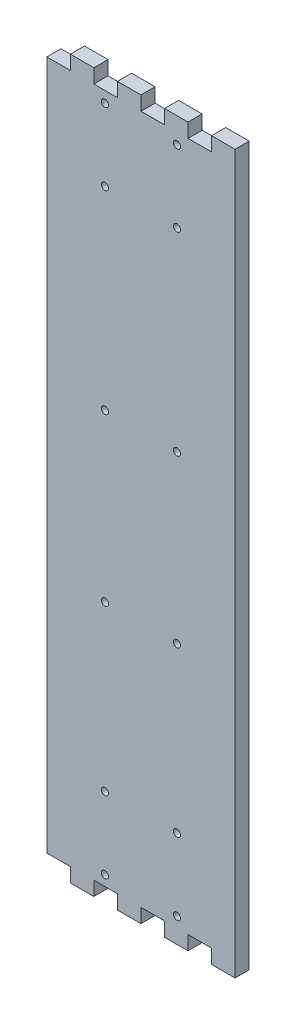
ISO-10303-21;
HEADER;
FILE_DESCRIPTION(('STEP AP214'),'2;1');
FILE_NAME('part.step','',(''),(''),'','','');
FILE_SCHEMA(('AUTOMOTIVE_DESIGN { 1 0 10303 214 1 1 1 1 }'));
ENDSEC;
DATA;
#1=APPLICATION_CONTEXT('core data for automotive mechanical design processes');
#2=APPLICATION_PROTOCOL_DEFINITION('international standard','automotive_design',2000,#1);
#3=PRODUCT_CONTEXT('',#1,'mechanical');
#4=PRODUCT('Part','Part','',(#3));
#5=PRODUCT_RELATED_PRODUCT_CATEGORY('part','',(#4));
#6=PRODUCT_DEFINITION_FORMATION('','',#4);
#7=PRODUCT_DEFINITION_CONTEXT('part definition',#1,'design');
#8=PRODUCT_DEFINITION('design','',#6,#7);
#9=PRODUCT_DEFINITION_SHAPE('','',#8);
#10=(LENGTH_UNIT() NAMED_UNIT(*) SI_UNIT(.MILLI.,.METRE.));
#11=(NAMED_UNIT(*) PLANE_ANGLE_UNIT() SI_UNIT($,.RADIAN.));
#12=(NAMED_UNIT(*) SI_UNIT($,.STERADIAN.) SOLID_ANGLE_UNIT());
#13=UNCERTAINTY_MEASURE_WITH_UNIT(LENGTH_MEASURE(1.E-05),#10,'distance_accuracy_value','');
#14=(GEOMETRIC_REPRESENTATION_CONTEXT(3) GLOBAL_UNCERTAINTY_ASSIGNED_CONTEXT((#13)) GLOBAL_UNIT_ASSIGNED_CONTEXT((#10,
#11,#12)) REPRESENTATION_CONTEXT('',''));
#15=CARTESIAN_POINT('',(0.,0.,0.));
#16=DIRECTION('',(0.,0.,1.));
#17=DIRECTION('',(1.,0.,0.));
#18=AXIS2_PLACEMENT_3D('',#15,#16,#17);
#19=CARTESIAN_POINT('',(-30.,143.,6.));
#20=DIRECTION('',(0.,-1.,0.));
#21=DIRECTION('',(0.,0.,-1.));
#22=AXIS2_PLACEMENT_3D('',#19,#20,#21);
#23=PLANE('',#22);
#24=DIRECTION('',(-1.,0.,0.));
#25=VECTOR('',#24,1.);
#26=CARTESIAN_POINT('',(-30.,143.,0.));
#27=LINE('',#26,#25);
#28=CARTESIAN_POINT('',(-30.,143.,0.));
#29=VERTEX_POINT('',#28);
#30=CARTESIAN_POINT('',(-40.0000000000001,143.,0.));
#31=VERTEX_POINT('',#30);
#32=EDGE_CURVE('E531',#29,#31,#27,.T.);
#33=ORIENTED_EDGE('',*,*,#32,.T.);
#34=DIRECTION('',(0.,0.,-1.));
#35=VECTOR('',#34,1.);
#36=CARTESIAN_POINT('',(-40.0000000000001,143.,6.));
#37=LINE('',#36,#35);
#38=CARTESIAN_POINT('',(-40.0000000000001,143.,6.));
#39=VERTEX_POINT('',#38);
#40=EDGE_CURVE('E12',#39,#31,#37,.T.);
#41=ORIENTED_EDGE('',*,*,#40,.F.);
#42=DIRECTION('',(-1.,0.,0.));
#43=VECTOR('',#42,1.);
#44=CARTESIAN_POINT('',(-30.,143.,6.));
#45=LINE('',#44,#43);
#46=CARTESIAN_POINT('',(-30.,143.,6.));
#47=VERTEX_POINT('',#46);
#48=EDGE_CURVE('E420',#47,#39,#45,.T.);
#49=ORIENTED_EDGE('',*,*,#48,.F.);
#50=DIRECTION('',(0.,0.,-1.));
#51=VECTOR('',#50,1.);
#52=CARTESIAN_POINT('',(-30.,143.,6.));
#53=LINE('',#52,#51);
#54=EDGE_CURVE('E278',#47,#29,#53,.T.);
#55=ORIENTED_EDGE('',*,*,#54,.T.);
#56=EDGE_LOOP('',(#33,#41,#49,#55));
#57=FACE_BOUND('',#56,.T.);
#58=ADVANCED_FACE('F37',(#57),#23,.F.);
#59=CARTESIAN_POINT('',(-40.0000000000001,143.,6.));
#60=DIRECTION('',(1.,0.,0.));
#61=DIRECTION('',(0.,1.,0.));
#62=AXIS2_PLACEMENT_3D('',#59,#60,#61);
#63=PLANE('',#62);
#64=DIRECTION('',(0.,-1.,0.));
#65=VECTOR('',#64,1.);
#66=CARTESIAN_POINT('',(-40.0000000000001,143.,0.));
#67=LINE('',#66,#65);
#68=CARTESIAN_POINT('',(-40.,-150.,0.));
#69=VERTEX_POINT('',#68);
#70=EDGE_CURVE('E534',#31,#69,#67,.T.);
#71=ORIENTED_EDGE('',*,*,#70,.T.);
#72=DIRECTION('',(0.,0.,-1.));
#73=VECTOR('',#72,1.);
#74=CARTESIAN_POINT('',(-40.,-150.,6.));
#75=LINE('',#74,#73);
#76=CARTESIAN_POINT('',(-40.,-150.,6.));
#77=VERTEX_POINT('',#76);
#78=EDGE_CURVE('E46',#77,#69,#75,.T.);
#79=ORIENTED_EDGE('',*,*,#78,.F.);
#80=DIRECTION('',(0.,-1.,0.));
#81=VECTOR('',#80,1.);
#82=CARTESIAN_POINT('',(-40.0000000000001,143.,6.));
#83=LINE('',#82,#81);
#84=EDGE_CURVE('E170',#39,#77,#83,.T.);
#85=ORIENTED_EDGE('',*,*,#84,.F.);
#86=ORIENTED_EDGE('',*,*,#40,.T.);
#87=EDGE_LOOP('',(#71,#79,#85,#86));
#88=FACE_BOUND('',#87,.T.);
#89=ADVANCED_FACE('F583',(#88),#63,.F.);
#90=CARTESIAN_POINT('',(-29.9999999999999,-150.,6.));
#91=DIRECTION('',(0.,1.,0.));
#92=DIRECTION('',(0.,0.,1.));
#93=AXIS2_PLACEMENT_3D('',#90,#91,#92);
#94=PLANE('',#93);
#95=DIRECTION('',(1.,0.,0.));
#96=VECTOR('',#95,1.);
#97=CARTESIAN_POINT('',(-29.9999999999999,-150.,0.));
#98=LINE('',#97,#96);
#99=CARTESIAN_POINT('',(-29.9999999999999,-150.,0.));
#100=VERTEX_POINT('',#99);
#101=EDGE_CURVE('E595',#69,#100,#98,.T.);
#102=ORIENTED_EDGE('',*,*,#101,.T.);
#103=DIRECTION('',(0.,0.,-1.));
#104=VECTOR('',#103,1.);
#105=CARTESIAN_POINT('',(-29.9999999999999,-150.,6.));
#106=LINE('',#105,#104);
#107=CARTESIAN_POINT('',(-29.9999999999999,-150.,6.));
#108=VERTEX_POINT('',#107);
#109=EDGE_CURVE('E733',#108,#100,#106,.T.);
#110=ORIENTED_EDGE('',*,*,#109,.F.);
#111=DIRECTION('',(1.,0.,0.));
#112=VECTOR('',#111,1.);
#113=CARTESIAN_POINT('',(-29.9999999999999,-150.,6.));
#114=LINE('',#113,#112);
#115=EDGE_CURVE('E409',#77,#108,#114,.T.);
#116=ORIENTED_EDGE('',*,*,#115,.F.);
#117=ORIENTED_EDGE('',*,*,#78,.T.);
#118=EDGE_LOOP('',(#102,#110,#116,#117));
#119=FACE_BOUND('',#118,.T.);
#120=ADVANCED_FACE('F588',(#119),#94,.F.);
#121=CARTESIAN_POINT('',(-29.9999999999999,-156.,6.));
#122=DIRECTION('',(1.,0.,0.));
#123=DIRECTION('',(0.,0.,-1.));
#124=AXIS2_PLACEMENT_3D('',#121,#122,#123);
#125=PLANE('',#124);
#126=DIRECTION('',(0.,-1.,0.));
#127=VECTOR('',#126,1.);
#128=CARTESIAN_POINT('',(-29.9999999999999,-156.,0.));
#129=LINE('',#128,#127);
#130=CARTESIAN_POINT('',(-29.9999999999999,-156.,0.));
#131=VERTEX_POINT('',#130);
#132=EDGE_CURVE('E598',#100,#131,#129,.T.);
#133=ORIENTED_EDGE('',*,*,#132,.T.);
#134=DIRECTION('',(0.,0.,-1.));
#135=VECTOR('',#134,1.);
#136=CARTESIAN_POINT('',(-29.9999999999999,-156.,6.));
#137=LINE('',#136,#135);
#138=CARTESIAN_POINT('',(-29.9999999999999,-156.,6.));
#139=VERTEX_POINT('',#138);
#140=EDGE_CURVE('E730',#139,#131,#137,.T.);
#141=ORIENTED_EDGE('',*,*,#140,.F.);
#142=DIRECTION('',(0.,-1.,0.));
#143=VECTOR('',#142,1.);
#144=CARTESIAN_POINT('',(-29.9999999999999,-156.,6.));
#145=LINE('',#144,#143);
#146=EDGE_CURVE('E405',#108,#139,#145,.T.);
#147=ORIENTED_EDGE('',*,*,#146,.F.);
#148=ORIENTED_EDGE('',*,*,#109,.T.);
#149=EDGE_LOOP('',(#133,#141,#147,#148));
#150=FACE_BOUND('',#149,.T.);
#151=ADVANCED_FACE('F871',(#150),#125,.F.);
#152=CARTESIAN_POINT('',(-19.9999999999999,-156.,6.));
#153=DIRECTION('',(0.,1.,0.));
#154=DIRECTION('',(0.,0.,1.));
#155=AXIS2_PLACEMENT_3D('',#152,#153,#154);
#156=PLANE('',#155);
#157=DIRECTION('',(1.,0.,0.));
#158=VECTOR('',#157,1.);
#159=CARTESIAN_POINT('',(-19.9999999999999,-156.,0.));
#160=LINE('',#159,#158);
#161=CARTESIAN_POINT('',(-19.9999999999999,-156.,0.));
#162=VERTEX_POINT('',#161);
#163=EDGE_CURVE('E602',#131,#162,#160,.T.);
#164=ORIENTED_EDGE('',*,*,#163,.T.);
#165=DIRECTION('',(0.,0.,-1.));
#166=VECTOR('',#165,1.);
#167=CARTESIAN_POINT('',(-19.9999999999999,-156.,6.));
#168=LINE('',#167,#166);
#169=CARTESIAN_POINT('',(-19.9999999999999,-156.,6.));
#170=VERTEX_POINT('',#169);
#171=EDGE_CURVE('E727',#170,#162,#168,.T.);
#172=ORIENTED_EDGE('',*,*,#171,.F.);
#173=DIRECTION('',(1.,0.,0.));
#174=VECTOR('',#173,1.);
#175=CARTESIAN_POINT('',(-19.9999999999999,-156.,6.));
#176=LINE('',#175,#174);
#177=EDGE_CURVE('E402',#139,#170,#176,.T.);
#178=ORIENTED_EDGE('',*,*,#177,.F.);
#179=ORIENTED_EDGE('',*,*,#140,.T.);
#180=EDGE_LOOP('',(#164,#172,#178,#179));
#181=FACE_BOUND('',#180,.T.);
#182=ADVANCED_FACE('F869',(#181),#156,.F.);
#183=CARTESIAN_POINT('',(-19.9999999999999,-156.,6.));
#184=DIRECTION('',(-1.,0.,0.));
#185=DIRECTION('',(0.,-1.,0.));
#186=AXIS2_PLACEMENT_3D('',#183,#184,#185);
#187=PLANE('',#186);
#188=DIRECTION('',(0.,1.,0.));
#189=VECTOR('',#188,1.);
#190=CARTESIAN_POINT('',(-19.9999999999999,-156.,0.));
#191=LINE('',#190,#189);
#192=CARTESIAN_POINT('',(-20.,-150.,0.));
#193=VERTEX_POINT('',#192);
#194=EDGE_CURVE('E604',#162,#193,#191,.T.);
#195=ORIENTED_EDGE('',*,*,#194,.T.);
#196=DIRECTION('',(0.,0.,-1.));
#197=VECTOR('',#196,1.);
#198=CARTESIAN_POINT('',(-20.,-150.,6.));
#199=LINE('',#198,#197);
#200=CARTESIAN_POINT('',(-20.,-150.,6.));
#201=VERTEX_POINT('',#200);
#202=EDGE_CURVE('E724',#201,#193,#199,.T.);
#203=ORIENTED_EDGE('',*,*,#202,.F.);
#204=DIRECTION('',(0.,1.,0.));
#205=VECTOR('',#204,1.);
#206=CARTESIAN_POINT('',(-19.9999999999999,-156.,6.));
#207=LINE('',#206,#205);
#208=EDGE_CURVE('E394',#170,#201,#207,.T.);
#209=ORIENTED_EDGE('',*,*,#208,.F.);
#210=ORIENTED_EDGE('',*,*,#171,.T.);
#211=EDGE_LOOP('',(#195,#203,#209,#210));
#212=FACE_BOUND('',#211,.T.);
#213=ADVANCED_FACE('F865',(#212),#187,.F.);
#214=CARTESIAN_POINT('',(-9.9999999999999,-150.,6.));
#215=DIRECTION('',(0.,1.,0.));
#216=DIRECTION('',(0.,0.,1.));
#217=AXIS2_PLACEMENT_3D('',#214,#215,#216);
#218=PLANE('',#217);
#219=DIRECTION('',(1.,0.,0.));
#220=VECTOR('',#219,1.);
#221=CARTESIAN_POINT('',(-9.9999999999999,-150.,0.));
#222=LINE('',#221,#220);
#223=CARTESIAN_POINT('',(-9.9999999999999,-150.,0.));
#224=VERTEX_POINT('',#223);
#225=EDGE_CURVE('E606',#193,#224,#222,.T.);
#226=ORIENTED_EDGE('',*,*,#225,.T.);
#227=DIRECTION('',(0.,0.,-1.));
#228=VECTOR('',#227,1.);
#229=CARTESIAN_POINT('',(-9.9999999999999,-150.,6.));
#230=LINE('',#229,#228);
#231=CARTESIAN_POINT('',(-9.9999999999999,-150.,6.));
#232=VERTEX_POINT('',#231);
#233=EDGE_CURVE('E721',#232,#224,#230,.T.);
#234=ORIENTED_EDGE('',*,*,#233,.F.);
#235=DIRECTION('',(1.,0.,0.));
#236=VECTOR('',#235,1.);
#237=CARTESIAN_POINT('',(-9.9999999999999,-150.,6.));
#238=LINE('',#237,#236);
#239=EDGE_CURVE('E390',#201,#232,#238,.T.);
#240=ORIENTED_EDGE('',*,*,#239,.F.);
#241=ORIENTED_EDGE('',*,*,#202,.T.);
#242=EDGE_LOOP('',(#226,#234,#240,#241));
#243=FACE_BOUND('',#242,.T.);
#244=ADVANCED_FACE('F860',(#243),#218,.F.);
#245=CARTESIAN_POINT('',(-9.9999999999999,-156.,6.));
#246=DIRECTION('',(1.,0.,0.));
#247=DIRECTION('',(0.,0.,-1.));
#248=AXIS2_PLACEMENT_3D('',#245,#246,#247);
#249=PLANE('',#248);
#250=DIRECTION('',(0.,-1.,0.));
#251=VECTOR('',#250,1.);
#252=CARTESIAN_POINT('',(-9.9999999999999,-156.,0.));
#253=LINE('',#252,#251);
#254=CARTESIAN_POINT('',(-9.9999999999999,-156.,0.));
#255=VERTEX_POINT('',#254);
#256=EDGE_CURVE('E608',#224,#255,#253,.T.);
#257=ORIENTED_EDGE('',*,*,#256,.T.);
#258=DIRECTION('',(0.,0.,-1.));
#259=VECTOR('',#258,1.);
#260=CARTESIAN_POINT('',(-9.9999999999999,-156.,6.));
#261=LINE('',#260,#259);
#262=CARTESIAN_POINT('',(-9.9999999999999,-156.,6.));
#263=VERTEX_POINT('',#262);
#264=EDGE_CURVE('E718',#263,#255,#261,.T.);
#265=ORIENTED_EDGE('',*,*,#264,.F.);
#266=DIRECTION('',(0.,-1.,0.));
#267=VECTOR('',#266,1.);
#268=CARTESIAN_POINT('',(-9.9999999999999,-156.,6.));
#269=LINE('',#268,#267);
#270=EDGE_CURVE('E386',#232,#263,#269,.T.);
#271=ORIENTED_EDGE('',*,*,#270,.F.);
#272=ORIENTED_EDGE('',*,*,#233,.T.);
#273=EDGE_LOOP('',(#257,#265,#271,#272));
#274=FACE_BOUND('',#273,.T.);
#275=ADVANCED_FACE('F854',(#274),#249,.F.);
#276=CARTESIAN_POINT('',(0.,-156.,6.));
#277=DIRECTION('',(0.,1.,0.));
#278=DIRECTION('',(0.,0.,1.));
#279=AXIS2_PLACEMENT_3D('',#276,#277,#278);
#280=PLANE('',#279);
#281=DIRECTION('',(1.,0.,0.));
#282=VECTOR('',#281,1.);
#283=CARTESIAN_POINT('',(0.,-156.,0.));
#284=LINE('',#283,#282);
#285=CARTESIAN_POINT('',(0.,-156.,0.));
#286=VERTEX_POINT('',#285);
#287=EDGE_CURVE('E610',#255,#286,#284,.T.);
#288=ORIENTED_EDGE('',*,*,#287,.T.);
#289=DIRECTION('',(0.,0.,-1.));
#290=VECTOR('',#289,1.);
#291=CARTESIAN_POINT('',(0.,-156.,6.));
#292=LINE('',#291,#290);
#293=CARTESIAN_POINT('',(0.,-156.,6.));
#294=VERTEX_POINT('',#293);
#295=EDGE_CURVE('E715',#294,#286,#292,.T.);
#296=ORIENTED_EDGE('',*,*,#295,.F.);
#297=DIRECTION('',(1.,0.,0.));
#298=VECTOR('',#297,1.);
#299=CARTESIAN_POINT('',(0.,-156.,6.));
#300=LINE('',#299,#298);
#301=EDGE_CURVE('E383',#263,#294,#300,.T.);
#302=ORIENTED_EDGE('',*,*,#301,.F.);
#303=ORIENTED_EDGE('',*,*,#264,.T.);
#304=EDGE_LOOP('',(#288,#296,#302,#303));
#305=FACE_BOUND('',#304,.T.);
#306=ADVANCED_FACE('F850',(#305),#280,.F.);
#307=CARTESIAN_POINT('',(0.,-156.,6.));
#308=DIRECTION('',(-1.,0.,0.));
#309=DIRECTION('',(0.,-1.,0.));
#310=AXIS2_PLACEMENT_3D('',#307,#308,#309);
#311=PLANE('',#310);
#312=DIRECTION('',(0.,1.,0.));
#313=VECTOR('',#312,1.);
#314=CARTESIAN_POINT('',(0.,-156.,0.));
#315=LINE('',#314,#313);
#316=CARTESIAN_POINT('',(0.,-150.,0.));
#317=VERTEX_POINT('',#316);
#318=EDGE_CURVE('E612',#286,#317,#315,.T.);
#319=ORIENTED_EDGE('',*,*,#318,.T.);
#320=DIRECTION('',(0.,0.,-1.));
#321=VECTOR('',#320,1.);
#322=CARTESIAN_POINT('',(0.,-150.,6.));
#323=LINE('',#322,#321);
#324=CARTESIAN_POINT('',(0.,-150.,6.));
#325=VERTEX_POINT('',#324);
#326=EDGE_CURVE('E712',#325,#317,#323,.T.);
#327=ORIENTED_EDGE('',*,*,#326,.F.);
#328=DIRECTION('',(0.,1.,0.));
#329=VECTOR('',#328,1.);
#330=CARTESIAN_POINT('',(0.,-156.,6.));
#331=LINE('',#330,#329);
#332=EDGE_CURVE('E375',#294,#325,#331,.T.);
#333=ORIENTED_EDGE('',*,*,#332,.F.);
#334=ORIENTED_EDGE('',*,*,#295,.T.);
#335=EDGE_LOOP('',(#319,#327,#333,#334));
#336=FACE_BOUND('',#335,.T.);
#337=ADVANCED_FACE('F845',(#336),#311,.F.);
#338=CARTESIAN_POINT('',(10.0000000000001,-150.,6.));
#339=DIRECTION('',(0.,1.,0.));
#340=DIRECTION('',(0.,0.,1.));
#341=AXIS2_PLACEMENT_3D('',#338,#339,#340);
#342=PLANE('',#341);
#343=DIRECTION('',(1.,0.,0.));
#344=VECTOR('',#343,1.);
#345=CARTESIAN_POINT('',(10.0000000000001,-150.,0.));
#346=LINE('',#345,#344);
#347=CARTESIAN_POINT('',(10.0000000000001,-150.,0.));
#348=VERTEX_POINT('',#347);
#349=EDGE_CURVE('E614',#317,#348,#346,.T.);
#350=ORIENTED_EDGE('',*,*,#349,.T.);
#351=DIRECTION('',(0.,0.,-1.));
#352=VECTOR('',#351,1.);
#353=CARTESIAN_POINT('',(10.0000000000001,-150.,6.));
#354=LINE('',#353,#352);
#355=CARTESIAN_POINT('',(10.0000000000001,-150.,6.));
#356=VERTEX_POINT('',#355);
#357=EDGE_CURVE('E709',#356,#348,#354,.T.);
#358=ORIENTED_EDGE('',*,*,#357,.F.);
#359=DIRECTION('',(1.,0.,0.));
#360=VECTOR('',#359,1.);
#361=CARTESIAN_POINT('',(10.0000000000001,-150.,6.));
#362=LINE('',#361,#360);
#363=EDGE_CURVE('E371',#325,#356,#362,.T.);
#364=ORIENTED_EDGE('',*,*,#363,.F.);
#365=ORIENTED_EDGE('',*,*,#326,.T.);
#366=EDGE_LOOP('',(#350,#358,#364,#365));
#367=FACE_BOUND('',#366,.T.);
#368=ADVANCED_FACE('F839',(#367),#342,.F.);
#369=CARTESIAN_POINT('',(10.0000000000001,-156.,6.));
#370=DIRECTION('',(1.,0.,0.));
#371=DIRECTION('',(0.,0.,-1.));
#372=AXIS2_PLACEMENT_3D('',#369,#370,#371);
#373=PLANE('',#372);
#374=DIRECTION('',(0.,-1.,0.));
#375=VECTOR('',#374,1.);
#376=CARTESIAN_POINT('',(10.0000000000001,-156.,0.));
#377=LINE('',#376,#375);
#378=CARTESIAN_POINT('',(10.0000000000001,-156.,0.));
#379=VERTEX_POINT('',#378);
#380=EDGE_CURVE('E616',#348,#379,#377,.T.);
#381=ORIENTED_EDGE('',*,*,#380,.T.);
#382=DIRECTION('',(0.,0.,-1.));
#383=VECTOR('',#382,1.);
#384=CARTESIAN_POINT('',(10.0000000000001,-156.,6.));
#385=LINE('',#384,#383);
#386=CARTESIAN_POINT('',(10.0000000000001,-156.,6.));
#387=VERTEX_POINT('',#386);
#388=EDGE_CURVE('E706',#387,#379,#385,.T.);
#389=ORIENTED_EDGE('',*,*,#388,.F.);
#390=DIRECTION('',(0.,-1.,0.));
#391=VECTOR('',#390,1.);
#392=CARTESIAN_POINT('',(10.0000000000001,-156.,6.));
#393=LINE('',#392,#391);
#394=EDGE_CURVE('E367',#356,#387,#393,.T.);
#395=ORIENTED_EDGE('',*,*,#394,.F.);
#396=ORIENTED_EDGE('',*,*,#357,.T.);
#397=EDGE_LOOP('',(#381,#389,#395,#396));
#398=FACE_BOUND('',#397,.T.);
#399=ADVANCED_FACE('F835',(#398),#373,.F.);
#400=CARTESIAN_POINT('',(20.0000000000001,-156.,6.));
#401=DIRECTION('',(0.,1.,0.));
#402=DIRECTION('',(0.,0.,1.));
#403=AXIS2_PLACEMENT_3D('',#400,#401,#402);
#404=PLANE('',#403);
#405=DIRECTION('',(1.,0.,0.));
#406=VECTOR('',#405,1.);
#407=CARTESIAN_POINT('',(20.0000000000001,-156.,0.));
#408=LINE('',#407,#406);
#409=CARTESIAN_POINT('',(20.0000000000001,-156.,0.));
#410=VERTEX_POINT('',#409);
#411=EDGE_CURVE('E618',#379,#410,#408,.T.);
#412=ORIENTED_EDGE('',*,*,#411,.T.);
#413=DIRECTION('',(0.,0.,-1.));
#414=VECTOR('',#413,1.);
#415=CARTESIAN_POINT('',(20.0000000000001,-156.,6.));
#416=LINE('',#415,#414);
#417=CARTESIAN_POINT('',(20.0000000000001,-156.,6.));
#418=VERTEX_POINT('',#417);
#419=EDGE_CURVE('E703',#418,#410,#416,.T.);
#420=ORIENTED_EDGE('',*,*,#419,.F.);
#421=DIRECTION('',(1.,0.,0.));
#422=VECTOR('',#421,1.);
#423=CARTESIAN_POINT('',(20.0000000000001,-156.,6.));
#424=LINE('',#423,#422);
#425=EDGE_CURVE('E364',#387,#418,#424,.T.);
#426=ORIENTED_EDGE('',*,*,#425,.F.);
#427=ORIENTED_EDGE('',*,*,#388,.T.);
#428=EDGE_LOOP('',(#412,#420,#426,#427));
#429=FACE_BOUND('',#428,.T.);
#430=ADVANCED_FACE('F830',(#429),#404,.F.);
#431=CARTESIAN_POINT('',(20.0000000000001,-156.,6.));
#432=DIRECTION('',(-1.,0.,0.));
#433=DIRECTION('',(0.,-1.,0.));
#434=AXIS2_PLACEMENT_3D('',#431,#432,#433);
#435=PLANE('',#434);
#436=DIRECTION('',(0.,1.,0.));
#437=VECTOR('',#436,1.);
#438=CARTESIAN_POINT('',(20.0000000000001,-156.,0.));
#439=LINE('',#438,#437);
#440=CARTESIAN_POINT('',(20.,-150.,0.));
#441=VERTEX_POINT('',#440);
#442=EDGE_CURVE('E620',#410,#441,#439,.T.);
#443=ORIENTED_EDGE('',*,*,#442,.T.);
#444=DIRECTION('',(0.,0.,-1.));
#445=VECTOR('',#444,1.);
#446=CARTESIAN_POINT('',(20.,-150.,6.));
#447=LINE('',#446,#445);
#448=CARTESIAN_POINT('',(20.,-150.,6.));
#449=VERTEX_POINT('',#448);
#450=EDGE_CURVE('E700',#449,#441,#447,.T.);
#451=ORIENTED_EDGE('',*,*,#450,.F.);
#452=DIRECTION('',(0.,1.,0.));
#453=VECTOR('',#452,1.);
#454=CARTESIAN_POINT('',(20.0000000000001,-156.,6.));
#455=LINE('',#454,#453);
#456=EDGE_CURVE('E356',#418,#449,#455,.T.);
#457=ORIENTED_EDGE('',*,*,#456,.F.);
#458=ORIENTED_EDGE('',*,*,#419,.T.);
#459=EDGE_LOOP('',(#443,#451,#457,#458));
#460=FACE_BOUND('',#459,.T.);
#461=ADVANCED_FACE('F824',(#460),#435,.F.);
#462=CARTESIAN_POINT('',(30.0000000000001,-150.,6.));
#463=DIRECTION('',(0.,1.,0.));
#464=DIRECTION('',(0.,0.,1.));
#465=AXIS2_PLACEMENT_3D('',#462,#463,#464);
#466=PLANE('',#465);
#467=DIRECTION('',(1.,0.,0.));
#468=VECTOR('',#467,1.);
#469=CARTESIAN_POINT('',(30.0000000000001,-150.,0.));
#470=LINE('',#469,#468);
#471=CARTESIAN_POINT('',(30.0000000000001,-150.,0.));
#472=VERTEX_POINT('',#471);
#473=EDGE_CURVE('E622',#441,#472,#470,.T.);
#474=ORIENTED_EDGE('',*,*,#473,.T.);
#475=DIRECTION('',(0.,0.,-1.));
#476=VECTOR('',#475,1.);
#477=CARTESIAN_POINT('',(30.0000000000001,-150.,6.));
#478=LINE('',#477,#476);
#479=CARTESIAN_POINT('',(30.0000000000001,-150.,6.));
#480=VERTEX_POINT('',#479);
#481=EDGE_CURVE('E697',#480,#472,#478,.T.);
#482=ORIENTED_EDGE('',*,*,#481,.F.);
#483=DIRECTION('',(1.,0.,0.));
#484=VECTOR('',#483,1.);
#485=CARTESIAN_POINT('',(30.0000000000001,-150.,6.));
#486=LINE('',#485,#484);
#487=EDGE_CURVE('E352',#449,#480,#486,.T.);
#488=ORIENTED_EDGE('',*,*,#487,.F.);
#489=ORIENTED_EDGE('',*,*,#450,.T.);
#490=EDGE_LOOP('',(#474,#482,#488,#489));
#491=FACE_BOUND('',#490,.T.);
#492=ADVANCED_FACE('F820',(#491),#466,.F.);
#493=CARTESIAN_POINT('',(30.0000000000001,-156.,6.));
#494=DIRECTION('',(1.,0.,0.));
#495=DIRECTION('',(0.,0.,-1.));
#496=AXIS2_PLACEMENT_3D('',#493,#494,#495);
#497=PLANE('',#496);
#498=DIRECTION('',(0.,-1.,0.));
#499=VECTOR('',#498,1.);
#500=CARTESIAN_POINT('',(30.0000000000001,-156.,0.));
#501=LINE('',#500,#499);
#502=CARTESIAN_POINT('',(30.0000000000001,-156.,0.));
#503=VERTEX_POINT('',#502);
#504=EDGE_CURVE('E624',#472,#503,#501,.T.);
#505=ORIENTED_EDGE('',*,*,#504,.T.);
#506=DIRECTION('',(0.,0.,-1.));
#507=VECTOR('',#506,1.);
#508=CARTESIAN_POINT('',(30.0000000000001,-156.,6.));
#509=LINE('',#508,#507);
#510=CARTESIAN_POINT('',(30.0000000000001,-156.,6.));
#511=VERTEX_POINT('',#510);
#512=EDGE_CURVE('E694',#511,#503,#509,.T.);
#513=ORIENTED_EDGE('',*,*,#512,.F.);
#514=DIRECTION('',(0.,-1.,0.));
#515=VECTOR('',#514,1.);
#516=CARTESIAN_POINT('',(30.0000000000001,-156.,6.));
#517=LINE('',#516,#515);
#518=EDGE_CURVE('E348',#480,#511,#517,.T.);
#519=ORIENTED_EDGE('',*,*,#518,.F.);
#520=ORIENTED_EDGE('',*,*,#481,.T.);
#521=EDGE_LOOP('',(#505,#513,#519,#520));
#522=FACE_BOUND('',#521,.T.);
#523=ADVANCED_FACE('F815',(#522),#497,.F.);
#524=CARTESIAN_POINT('',(40.0000000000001,-156.,6.));
#525=DIRECTION('',(0.,1.,0.));
#526=DIRECTION('',(0.,0.,1.));
#527=AXIS2_PLACEMENT_3D('',#524,#525,#526);
#528=PLANE('',#527);
#529=DIRECTION('',(1.,0.,0.));
#530=VECTOR('',#529,1.);
#531=CARTESIAN_POINT('',(40.0000000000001,-156.,0.));
#532=LINE('',#531,#530);
#533=CARTESIAN_POINT('',(40.0000000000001,-156.,0.));
#534=VERTEX_POINT('',#533);
#535=EDGE_CURVE('E626',#503,#534,#532,.T.);
#536=ORIENTED_EDGE('',*,*,#535,.T.);
#537=DIRECTION('',(0.,0.,-1.));
#538=VECTOR('',#537,1.);
#539=CARTESIAN_POINT('',(40.0000000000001,-156.,6.));
#540=LINE('',#539,#538);
#541=CARTESIAN_POINT('',(40.0000000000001,-156.,6.));
#542=VERTEX_POINT('',#541);
#543=EDGE_CURVE('E691',#542,#534,#540,.T.);
#544=ORIENTED_EDGE('',*,*,#543,.F.);
#545=DIRECTION('',(1.,0.,0.));
#546=VECTOR('',#545,1.);
#547=CARTESIAN_POINT('',(40.0000000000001,-156.,6.));
#548=LINE('',#547,#546);
#549=EDGE_CURVE('E345',#511,#542,#548,.T.);
#550=ORIENTED_EDGE('',*,*,#549,.F.);
#551=ORIENTED_EDGE('',*,*,#512,.T.);
#552=EDGE_LOOP('',(#536,#544,#550,#551));
#553=FACE_BOUND('',#552,.T.);
#554=ADVANCED_FACE('F809',(#553),#528,.F.);
#555=CARTESIAN_POINT('',(40.0000000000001,149.,6.));
#556=DIRECTION('',(-1.,0.,0.));
#557=DIRECTION('',(0.,0.,1.));
#558=AXIS2_PLACEMENT_3D('',#555,#556,#557);
#559=PLANE('',#558);
#560=DIRECTION('',(0.,1.,0.));
#561=VECTOR('',#560,1.);
#562=CARTESIAN_POINT('',(40.0000000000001,149.,0.));
#563=LINE('',#562,#561);
#564=CARTESIAN_POINT('',(40.0000000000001,149.,0.));
#565=VERTEX_POINT('',#564);
#566=EDGE_CURVE('E628',#534,#565,#563,.T.);
#567=ORIENTED_EDGE('',*,*,#566,.T.);
#568=DIRECTION('',(0.,0.,-1.));
#569=VECTOR('',#568,1.);
#570=CARTESIAN_POINT('',(40.0000000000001,149.,6.));
#571=LINE('',#570,#569);
#572=CARTESIAN_POINT('',(40.0000000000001,149.,6.));
#573=VERTEX_POINT('',#572);
#574=EDGE_CURVE('E688',#573,#565,#571,.T.);
#575=ORIENTED_EDGE('',*,*,#574,.F.);
#576=DIRECTION('',(0.,1.,0.));
#577=VECTOR('',#576,1.);
#578=CARTESIAN_POINT('',(40.0000000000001,149.,6.));
#579=LINE('',#578,#577);
#580=EDGE_CURVE('E337',#542,#573,#579,.T.);
#581=ORIENTED_EDGE('',*,*,#580,.F.);
#582=ORIENTED_EDGE('',*,*,#543,.T.);
#583=EDGE_LOOP('',(#567,#575,#581,#582));
#584=FACE_BOUND('',#583,.T.);
#585=ADVANCED_FACE('F805',(#584),#559,.F.);
#586=CARTESIAN_POINT('',(40.0000000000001,149.,6.));
#587=DIRECTION('',(0.,-1.,0.));
#588=DIRECTION('',(0.,0.,-1.));
#589=AXIS2_PLACEMENT_3D('',#586,#587,#588);
#590=PLANE('',#589);
#591=DIRECTION('',(-1.,0.,0.));
#592=VECTOR('',#591,1.);
#593=CARTESIAN_POINT('',(40.0000000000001,149.,0.));
#594=LINE('',#593,#592);
#595=CARTESIAN_POINT('',(30.0000000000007,149.,0.));
#596=VERTEX_POINT('',#595);
#597=EDGE_CURVE('E630',#565,#596,#594,.T.);
#598=ORIENTED_EDGE('',*,*,#597,.T.);
#599=DIRECTION('',(0.,0.,-1.));
#600=VECTOR('',#599,1.);
#601=CARTESIAN_POINT('',(30.0000000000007,149.,6.));
#602=LINE('',#601,#600);
#603=CARTESIAN_POINT('',(30.0000000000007,149.,6.));
#604=VERTEX_POINT('',#603);
#605=EDGE_CURVE('E685',#604,#596,#602,.T.);
#606=ORIENTED_EDGE('',*,*,#605,.F.);
#607=DIRECTION('',(-1.,0.,0.));
#608=VECTOR('',#607,1.);
#609=CARTESIAN_POINT('',(40.0000000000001,149.,6.));
#610=LINE('',#609,#608);
#611=EDGE_CURVE('E333',#573,#604,#610,.T.);
#612=ORIENTED_EDGE('',*,*,#611,.F.);
#613=ORIENTED_EDGE('',*,*,#574,.T.);
#614=EDGE_LOOP('',(#598,#606,#612,#613));
#615=FACE_BOUND('',#614,.T.);
#616=ADVANCED_FACE('F800',(#615),#590,.F.);
#617=CARTESIAN_POINT('',(30.0000000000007,149.,6.));
#618=DIRECTION('',(1.,0.,0.));
#619=DIRECTION('',(0.,0.,-1.));
#620=AXIS2_PLACEMENT_3D('',#617,#618,#619);
#621=PLANE('',#620);
#622=DIRECTION('',(0.,-1.,0.));
#623=VECTOR('',#622,1.);
#624=CARTESIAN_POINT('',(30.0000000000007,149.,0.));
#625=LINE('',#624,#623);
#626=CARTESIAN_POINT('',(30.0000000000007,143.,0.));
#627=VERTEX_POINT('',#626);
#628=EDGE_CURVE('E632',#596,#627,#625,.T.);
#629=ORIENTED_EDGE('',*,*,#628,.T.);
#630=DIRECTION('',(0.,0.,-1.));
#631=VECTOR('',#630,1.);
#632=CARTESIAN_POINT('',(30.0000000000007,143.,6.));
#633=LINE('',#632,#631);
#634=CARTESIAN_POINT('',(30.0000000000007,143.,6.));
#635=VERTEX_POINT('',#634);
#636=EDGE_CURVE('E682',#635,#627,#633,.T.);
#637=ORIENTED_EDGE('',*,*,#636,.F.);
#638=DIRECTION('',(0.,-1.,0.));
#639=VECTOR('',#638,1.);
#640=CARTESIAN_POINT('',(30.0000000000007,149.,6.));
#641=LINE('',#640,#639);
#642=EDGE_CURVE('E329',#604,#635,#641,.T.);
#643=ORIENTED_EDGE('',*,*,#642,.F.);
#644=ORIENTED_EDGE('',*,*,#605,.T.);
#645=EDGE_LOOP('',(#629,#637,#643,#644));
#646=FACE_BOUND('',#645,.T.);
#647=ADVANCED_FACE('F794',(#646),#621,.F.);
#648=CARTESIAN_POINT('',(30.0000000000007,143.,6.));
#649=DIRECTION('',(0.,-1.,0.));
#650=DIRECTION('',(0.,0.,-1.));
#651=AXIS2_PLACEMENT_3D('',#648,#649,#650);
#652=PLANE('',#651);
#653=DIRECTION('',(-1.,0.,0.));
#654=VECTOR('',#653,1.);
#655=CARTESIAN_POINT('',(30.0000000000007,143.,0.));
#656=LINE('',#655,#654);
#657=CARTESIAN_POINT('',(20.0000000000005,143.,0.));
#658=VERTEX_POINT('',#657);
#659=EDGE_CURVE('E634',#627,#658,#656,.T.);
#660=ORIENTED_EDGE('',*,*,#659,.T.);
#661=DIRECTION('',(0.,0.,-1.));
#662=VECTOR('',#661,1.);
#663=CARTESIAN_POINT('',(20.0000000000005,143.,6.));
#664=LINE('',#663,#662);
#665=CARTESIAN_POINT('',(20.0000000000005,143.,6.));
#666=VERTEX_POINT('',#665);
#667=EDGE_CURVE('E679',#666,#658,#664,.T.);
#668=ORIENTED_EDGE('',*,*,#667,.F.);
#669=DIRECTION('',(-1.,0.,0.));
#670=VECTOR('',#669,1.);
#671=CARTESIAN_POINT('',(30.0000000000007,143.,6.));
#672=LINE('',#671,#670);
#673=EDGE_CURVE('E326',#635,#666,#672,.T.);
#674=ORIENTED_EDGE('',*,*,#673,.F.);
#675=ORIENTED_EDGE('',*,*,#636,.T.);
#676=EDGE_LOOP('',(#660,#668,#674,#675));
#677=FACE_BOUND('',#676,.T.);
#678=ADVANCED_FACE('F790',(#677),#652,.F.);
#679=CARTESIAN_POINT('',(20.0000000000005,149.,6.));
#680=DIRECTION('',(-1.,0.,0.));
#681=DIRECTION('',(0.,0.,1.));
#682=AXIS2_PLACEMENT_3D('',#679,#680,#681);
#683=PLANE('',#682);
#684=DIRECTION('',(0.,1.,0.));
#685=VECTOR('',#684,1.);
#686=CARTESIAN_POINT('',(20.0000000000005,149.,0.));
#687=LINE('',#686,#685);
#688=CARTESIAN_POINT('',(20.0000000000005,149.,0.));
#689=VERTEX_POINT('',#688);
#690=EDGE_CURVE('E636',#658,#689,#687,.T.);
#691=ORIENTED_EDGE('',*,*,#690,.T.);
#692=DIRECTION('',(0.,0.,-1.));
#693=VECTOR('',#692,1.);
#694=CARTESIAN_POINT('',(20.0000000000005,149.,6.));
#695=LINE('',#694,#693);
#696=CARTESIAN_POINT('',(20.0000000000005,149.,6.));
#697=VERTEX_POINT('',#696);
#698=EDGE_CURVE('E676',#697,#689,#695,.T.);
#699=ORIENTED_EDGE('',*,*,#698,.F.);
#700=DIRECTION('',(0.,1.,0.));
#701=VECTOR('',#700,1.);
#702=CARTESIAN_POINT('',(20.0000000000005,149.,6.));
#703=LINE('',#702,#701);
#704=EDGE_CURVE('E318',#666,#697,#703,.T.);
#705=ORIENTED_EDGE('',*,*,#704,.F.);
#706=ORIENTED_EDGE('',*,*,#667,.T.);
#707=EDGE_LOOP('',(#691,#699,#705,#706));
#708=FACE_BOUND('',#707,.T.);
#709=ADVANCED_FACE('F785',(#708),#683,.F.);
#710=CARTESIAN_POINT('',(20.0000000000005,149.,6.));
#711=DIRECTION('',(0.,-1.,0.));
#712=DIRECTION('',(0.,0.,-1.));
#713=AXIS2_PLACEMENT_3D('',#710,#711,#712);
#714=PLANE('',#713);
#715=DIRECTION('',(-1.,0.,0.));
#716=VECTOR('',#715,1.);
#717=CARTESIAN_POINT('',(20.0000000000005,149.,0.));
#718=LINE('',#717,#716);
#719=CARTESIAN_POINT('',(10.0000000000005,149.,0.));
#720=VERTEX_POINT('',#719);
#721=EDGE_CURVE('E638',#689,#720,#718,.T.);
#722=ORIENTED_EDGE('',*,*,#721,.T.);
#723=DIRECTION('',(0.,0.,-1.));
#724=VECTOR('',#723,1.);
#725=CARTESIAN_POINT('',(10.0000000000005,149.,6.));
#726=LINE('',#725,#724);
#727=CARTESIAN_POINT('',(10.0000000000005,149.,6.));
#728=VERTEX_POINT('',#727);
#729=EDGE_CURVE('E673',#728,#720,#726,.T.);
#730=ORIENTED_EDGE('',*,*,#729,.F.);
#731=DIRECTION('',(-1.,0.,0.));
#732=VECTOR('',#731,1.);
#733=CARTESIAN_POINT('',(20.0000000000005,149.,6.));
#734=LINE('',#733,#732);
#735=EDGE_CURVE('E314',#697,#728,#734,.T.);
#736=ORIENTED_EDGE('',*,*,#735,.F.);
#737=ORIENTED_EDGE('',*,*,#698,.T.);
#738=EDGE_LOOP('',(#722,#730,#736,#737));
#739=FACE_BOUND('',#738,.T.);
#740=ADVANCED_FACE('F779',(#739),#714,.F.);
#741=CARTESIAN_POINT('',(10.0000000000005,149.,6.));
#742=DIRECTION('',(1.,0.,0.));
#743=DIRECTION('',(0.,0.,-1.));
#744=AXIS2_PLACEMENT_3D('',#741,#742,#743);
#745=PLANE('',#744);
#746=DIRECTION('',(0.,-1.,0.));
#747=VECTOR('',#746,1.);
#748=CARTESIAN_POINT('',(10.0000000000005,149.,0.));
#749=LINE('',#748,#747);
#750=CARTESIAN_POINT('',(10.0000000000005,143.,0.));
#751=VERTEX_POINT('',#750);
#752=EDGE_CURVE('E640',#720,#751,#749,.T.);
#753=ORIENTED_EDGE('',*,*,#752,.T.);
#754=DIRECTION('',(0.,0.,-1.));
#755=VECTOR('',#754,1.);
#756=CARTESIAN_POINT('',(10.0000000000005,143.,6.));
#757=LINE('',#756,#755);
#758=CARTESIAN_POINT('',(10.0000000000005,143.,6.));
#759=VERTEX_POINT('',#758);
#760=EDGE_CURVE('E670',#759,#751,#757,.T.);
#761=ORIENTED_EDGE('',*,*,#760,.F.);
#762=DIRECTION('',(0.,-1.,0.));
#763=VECTOR('',#762,1.);
#764=CARTESIAN_POINT('',(10.0000000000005,149.,6.));
#765=LINE('',#764,#763);
#766=EDGE_CURVE('E310',#728,#759,#765,.T.);
#767=ORIENTED_EDGE('',*,*,#766,.F.);
#768=ORIENTED_EDGE('',*,*,#729,.T.);
#769=EDGE_LOOP('',(#753,#761,#767,#768));
#770=FACE_BOUND('',#769,.T.);
#771=ADVANCED_FACE('F775',(#770),#745,.F.);
#772=CARTESIAN_POINT('',(10.0000000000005,143.,6.));
#773=DIRECTION('',(0.,-1.,0.));
#774=DIRECTION('',(0.,0.,-1.));
#775=AXIS2_PLACEMENT_3D('',#772,#773,#774);
#776=PLANE('',#775);
#777=DIRECTION('',(-1.,0.,0.));
#778=VECTOR('',#777,1.);
#779=CARTESIAN_POINT('',(10.0000000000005,143.,0.));
#780=LINE('',#779,#778);
#781=CARTESIAN_POINT('',(2.35922392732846E-13,143.,0.));
#782=VERTEX_POINT('',#781);
#783=EDGE_CURVE('E642',#751,#782,#780,.T.);
#784=ORIENTED_EDGE('',*,*,#783,.T.);
#785=DIRECTION('',(0.,0.,-1.));
#786=VECTOR('',#785,1.);
#787=CARTESIAN_POINT('',(2.35922392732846E-13,143.,6.));
#788=LINE('',#787,#786);
#789=CARTESIAN_POINT('',(2.35922392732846E-13,143.,6.));
#790=VERTEX_POINT('',#789);
#791=EDGE_CURVE('E667',#790,#782,#788,.T.);
#792=ORIENTED_EDGE('',*,*,#791,.F.);
#793=DIRECTION('',(-1.,0.,0.));
#794=VECTOR('',#793,1.);
#795=CARTESIAN_POINT('',(10.0000000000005,143.,6.));
#796=LINE('',#795,#794);
#797=EDGE_CURVE('E307',#759,#790,#796,.T.);
#798=ORIENTED_EDGE('',*,*,#797,.F.);
#799=ORIENTED_EDGE('',*,*,#760,.T.);
#800=EDGE_LOOP('',(#784,#792,#798,#799));
#801=FACE_BOUND('',#800,.T.);
#802=ADVANCED_FACE('F771',(#801),#776,.F.);
#803=CARTESIAN_POINT('',(2.35922392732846E-13,149.,6.));
#804=DIRECTION('',(-1.,0.,0.));
#805=DIRECTION('',(0.,0.,1.));
#806=AXIS2_PLACEMENT_3D('',#803,#804,#805);
#807=PLANE('',#806);
#808=DIRECTION('',(0.,1.,0.));
#809=VECTOR('',#808,1.);
#810=CARTESIAN_POINT('',(2.35922392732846E-13,149.,0.));
#811=LINE('',#810,#809);
#812=CARTESIAN_POINT('',(2.35922392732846E-13,149.,0.));
#813=VERTEX_POINT('',#812);
#814=EDGE_CURVE('E644',#782,#813,#811,.T.);
#815=ORIENTED_EDGE('',*,*,#814,.T.);
#816=DIRECTION('',(0.,0.,-1.));
#817=VECTOR('',#816,1.);
#818=CARTESIAN_POINT('',(2.35922392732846E-13,149.,6.));
#819=LINE('',#818,#817);
#820=CARTESIAN_POINT('',(2.35922392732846E-13,149.,6.));
#821=VERTEX_POINT('',#820);
#822=EDGE_CURVE('E664',#821,#813,#819,.T.);
#823=ORIENTED_EDGE('',*,*,#822,.F.);
#824=DIRECTION('',(0.,1.,0.));
#825=VECTOR('',#824,1.);
#826=CARTESIAN_POINT('',(2.35922392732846E-13,149.,6.));
#827=LINE('',#826,#825);
#828=EDGE_CURVE('E299',#790,#821,#827,.T.);
#829=ORIENTED_EDGE('',*,*,#828,.F.);
#830=ORIENTED_EDGE('',*,*,#791,.T.);
#831=EDGE_LOOP('',(#815,#823,#829,#830));
#832=FACE_BOUND('',#831,.T.);
#833=ADVANCED_FACE('F754',(#832),#807,.F.);
#834=CARTESIAN_POINT('',(2.35922392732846E-13,149.,6.));
#835=DIRECTION('',(0.,-1.,0.));
#836=DIRECTION('',(0.,0.,-1.));
#837=AXIS2_PLACEMENT_3D('',#834,#835,#836);
#838=PLANE('',#837);
#839=DIRECTION('',(-1.,0.,0.));
#840=VECTOR('',#839,1.);
#841=CARTESIAN_POINT('',(2.35922392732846E-13,149.,0.));
#842=LINE('',#841,#840);
#843=CARTESIAN_POINT('',(-9.99999999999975,149.,0.));
#844=VERTEX_POINT('',#843);
#845=EDGE_CURVE('E646',#813,#844,#842,.T.);
#846=ORIENTED_EDGE('',*,*,#845,.T.);
#847=DIRECTION('',(0.,0.,-1.));
#848=VECTOR('',#847,1.);
#849=CARTESIAN_POINT('',(-9.99999999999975,149.,6.));
#850=LINE('',#849,#848);
#851=CARTESIAN_POINT('',(-9.99999999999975,149.,6.));
#852=VERTEX_POINT('',#851);
#853=EDGE_CURVE('E661',#852,#844,#850,.T.);
#854=ORIENTED_EDGE('',*,*,#853,.F.);
#855=DIRECTION('',(-1.,0.,0.));
#856=VECTOR('',#855,1.);
#857=CARTESIAN_POINT('',(2.35922392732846E-13,149.,6.));
#858=LINE('',#857,#856);
#859=EDGE_CURVE('E295',#821,#852,#858,.T.);
#860=ORIENTED_EDGE('',*,*,#859,.F.);
#861=ORIENTED_EDGE('',*,*,#822,.T.);
#862=EDGE_LOOP('',(#846,#854,#860,#861));
#863=FACE_BOUND('',#862,.T.);
#864=ADVANCED_FACE('F758',(#863),#838,.F.);
#865=CARTESIAN_POINT('',(-9.99999999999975,149.,6.));
#866=DIRECTION('',(1.,0.,0.));
#867=DIRECTION('',(0.,0.,-1.));
#868=AXIS2_PLACEMENT_3D('',#865,#866,#867);
#869=PLANE('',#868);
#870=DIRECTION('',(0.,-1.,0.));
#871=VECTOR('',#870,1.);
#872=CARTESIAN_POINT('',(-9.99999999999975,149.,0.));
#873=LINE('',#872,#871);
#874=CARTESIAN_POINT('',(-9.99999999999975,143.,0.));
#875=VERTEX_POINT('',#874);
#876=EDGE_CURVE('E648',#844,#875,#873,.T.);
#877=ORIENTED_EDGE('',*,*,#876,.T.);
#878=DIRECTION('',(0.,0.,-1.));
#879=VECTOR('',#878,1.);
#880=CARTESIAN_POINT('',(-9.99999999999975,143.,6.));
#881=LINE('',#880,#879);
#882=CARTESIAN_POINT('',(-9.99999999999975,143.,6.));
#883=VERTEX_POINT('',#882);
#884=EDGE_CURVE('E658',#883,#875,#881,.T.);
#885=ORIENTED_EDGE('',*,*,#884,.F.);
#886=DIRECTION('',(0.,-1.,0.));
#887=VECTOR('',#886,1.);
#888=CARTESIAN_POINT('',(-9.99999999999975,149.,6.));
#889=LINE('',#888,#887);
#890=EDGE_CURVE('E291',#852,#883,#889,.T.);
#891=ORIENTED_EDGE('',*,*,#890,.F.);
#892=ORIENTED_EDGE('',*,*,#853,.T.);
#893=EDGE_LOOP('',(#877,#885,#891,#892));
#894=FACE_BOUND('',#893,.T.);
#895=ADVANCED_FACE('F763',(#894),#869,.F.);
#896=CARTESIAN_POINT('',(-9.99999999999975,143.,6.));
#897=DIRECTION('',(0.,-1.,0.));
#898=DIRECTION('',(0.,0.,-1.));
#899=AXIS2_PLACEMENT_3D('',#896,#897,#898);
#900=PLANE('',#899);
#901=DIRECTION('',(-1.,0.,0.));
#902=VECTOR('',#901,1.);
#903=CARTESIAN_POINT('',(-9.99999999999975,143.,0.));
#904=LINE('',#903,#902);
#905=CARTESIAN_POINT('',(-20.,143.,0.));
#906=VERTEX_POINT('',#905);
#907=EDGE_CURVE('E650',#875,#906,#904,.T.);
#908=ORIENTED_EDGE('',*,*,#907,.T.);
#909=DIRECTION('',(0.,0.,-1.));
#910=VECTOR('',#909,1.);
#911=CARTESIAN_POINT('',(-20.,143.,6.));
#912=LINE('',#911,#910);
#913=CARTESIAN_POINT('',(-20.,143.,6.));
#914=VERTEX_POINT('',#913);
#915=EDGE_CURVE('E271',#914,#906,#912,.T.);
#916=ORIENTED_EDGE('',*,*,#915,.F.);
#917=DIRECTION('',(-1.,0.,0.));
#918=VECTOR('',#917,1.);
#919=CARTESIAN_POINT('',(-9.99999999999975,143.,6.));
#920=LINE('',#919,#918);
#921=EDGE_CURVE('E261',#883,#914,#920,.T.);
#922=ORIENTED_EDGE('',*,*,#921,.F.);
#923=ORIENTED_EDGE('',*,*,#884,.T.);
#924=EDGE_LOOP('',(#908,#916,#922,#923));
#925=FACE_BOUND('',#924,.T.);
#926=ADVANCED_FACE('F766',(#925),#900,.F.);
#927=CARTESIAN_POINT('',(-20.,149.,6.));
#928=DIRECTION('',(-1.,0.,0.));
#929=DIRECTION('',(0.,0.,1.));
#930=AXIS2_PLACEMENT_3D('',#927,#928,#929);
#931=PLANE('',#930);
#932=DIRECTION('',(0.,1.,0.));
#933=VECTOR('',#932,1.);
#934=CARTESIAN_POINT('',(-20.,149.,0.));
#935=LINE('',#934,#933);
#936=CARTESIAN_POINT('',(-20.,149.,0.));
#937=VERTEX_POINT('',#936);
#938=EDGE_CURVE('E270',#906,#937,#935,.T.);
#939=ORIENTED_EDGE('',*,*,#938,.T.);
#940=DIRECTION('',(0.,0.,-1.));
#941=VECTOR('',#940,1.);
#942=CARTESIAN_POINT('',(-20.,149.,6.));
#943=LINE('',#942,#941);
#944=CARTESIAN_POINT('',(-20.,149.,6.));
#945=VERTEX_POINT('',#944);
#946=EDGE_CURVE('E267',#945,#937,#943,.T.);
#947=ORIENTED_EDGE('',*,*,#946,.F.);
#948=DIRECTION('',(0.,1.,0.));
#949=VECTOR('',#948,1.);
#950=CARTESIAN_POINT('',(-20.,149.,6.));
#951=LINE('',#950,#949);
#952=EDGE_CURVE('E255',#914,#945,#951,.T.);
#953=ORIENTED_EDGE('',*,*,#952,.F.);
#954=ORIENTED_EDGE('',*,*,#915,.T.);
#955=EDGE_LOOP('',(#939,#947,#953,#954));
#956=FACE_BOUND('',#955,.T.);
#957=ADVANCED_FACE('F268',(#956),#931,.F.);
#958=CARTESIAN_POINT('',(-20.,149.,6.));
#959=DIRECTION('',(0.,-1.,0.));
#960=DIRECTION('',(0.,0.,-1.));
#961=AXIS2_PLACEMENT_3D('',#958,#959,#960);
#962=PLANE('',#961);
#963=DIRECTION('',(-1.,0.,0.));
#964=VECTOR('',#963,1.);
#965=CARTESIAN_POINT('',(-20.,149.,0.));
#966=LINE('',#965,#964);
#967=CARTESIAN_POINT('',(-30.,149.,0.));
#968=VERTEX_POINT('',#967);
#969=EDGE_CURVE('E156',#937,#968,#966,.T.);
#970=ORIENTED_EDGE('',*,*,#969,.T.);
#971=DIRECTION('',(0.,0.,-1.));
#972=VECTOR('',#971,1.);
#973=CARTESIAN_POINT('',(-30.,149.,6.));
#974=LINE('',#973,#972);
#975=CARTESIAN_POINT('',(-30.,149.,6.));
#976=VERTEX_POINT('',#975);
#977=EDGE_CURVE('E272',#976,#968,#974,.T.);
#978=ORIENTED_EDGE('',*,*,#977,.F.);
#979=DIRECTION('',(-1.,0.,0.));
#980=VECTOR('',#979,1.);
#981=CARTESIAN_POINT('',(-20.,149.,6.));
#982=LINE('',#981,#980);
#983=EDGE_CURVE('E259',#945,#976,#982,.T.);
#984=ORIENTED_EDGE('',*,*,#983,.F.);
#985=ORIENTED_EDGE('',*,*,#946,.T.);
#986=EDGE_LOOP('',(#970,#978,#984,#985));
#987=FACE_BOUND('',#986,.T.);
#988=ADVANCED_FACE('F274',(#987),#962,.F.);
#989=CARTESIAN_POINT('',(-30.,149.,6.));
#990=DIRECTION('',(1.,0.,0.));
#991=DIRECTION('',(0.,0.,-1.));
#992=AXIS2_PLACEMENT_3D('',#989,#990,#991);
#993=PLANE('',#992);
#994=DIRECTION('',(0.,-1.,0.));
#995=VECTOR('',#994,1.);
#996=CARTESIAN_POINT('',(-30.,149.,0.));
#997=LINE('',#996,#995);
#998=EDGE_CURVE('E162',#968,#29,#997,.T.);
#999=ORIENTED_EDGE('',*,*,#998,.T.);
#1000=ORIENTED_EDGE('',*,*,#54,.F.);
#1001=DIRECTION('',(0.,-1.,0.));
#1002=VECTOR('',#1001,1.);
#1003=CARTESIAN_POINT('',(-30.,149.,6.));
#1004=LINE('',#1003,#1002);
#1005=EDGE_CURVE('E55',#976,#47,#1004,.T.);
#1006=ORIENTED_EDGE('',*,*,#1005,.F.);
#1007=ORIENTED_EDGE('',*,*,#977,.T.);
#1008=EDGE_LOOP('',(#999,#1000,#1006,#1007));
#1009=FACE_BOUND('',#1008,.T.);
#1010=ADVANCED_FACE('F508',(#1009),#993,.F.);
#1011=CARTESIAN_POINT('',(0.,0.,6.));
#1012=DIRECTION('',(0.,0.,1.));
#1013=DIRECTION('',(1.,0.,0.));
#1014=AXIS2_PLACEMENT_3D('',#1011,#1012,#1013);
#1015=PLANE('',#1014);
#1016=CARTESIAN_POINT('',(-15.3000000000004,-45.2999999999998,6.));
#1017=DIRECTION('',(0.,0.,1.));
#1018=DIRECTION('',(1.,0.,0.));
#1019=AXIS2_PLACEMENT_3D('',#1016,#1017,#1018);
#1020=CIRCLE('',#1019,1.5);
#1021=CARTESIAN_POINT('',(-13.8000000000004,-45.2999999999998,6.));
#1022=VERTEX_POINT('',#1021);
#1023=EDGE_CURVE('E470',#1022,#1022,#1020,.T.);
#1024=ORIENTED_EDGE('',*,*,#1023,.F.);
#1025=EDGE_LOOP('',(#1024));
#1026=FACE_BOUND('',#1025,.T.);
#1027=CARTESIAN_POINT('',(15.3000000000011,138.300000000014,6.));
#1028=DIRECTION('',(0.,0.,1.));
#1029=DIRECTION('',(1.,0.,0.));
#1030=AXIS2_PLACEMENT_3D('',#1027,#1028,#1029);
#1031=CIRCLE('',#1030,1.5);
#1032=CARTESIAN_POINT('',(16.8000000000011,138.300000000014,6.));
#1033=VERTEX_POINT('',#1032);
#1034=EDGE_CURVE('E464',#1033,#1033,#1031,.T.);
#1035=ORIENTED_EDGE('',*,*,#1034,.F.);
#1036=EDGE_LOOP('',(#1035));
#1037=FACE_BOUND('',#1036,.T.);
#1038=CARTESIAN_POINT('',(15.3000000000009,107.700000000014,6.));
#1039=DIRECTION('',(0.,0.,1.));
#1040=DIRECTION('',(1.,0.,0.));
#1041=AXIS2_PLACEMENT_3D('',#1038,#1039,#1040);
#1042=CIRCLE('',#1041,1.5);
#1043=CARTESIAN_POINT('',(16.8000000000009,107.700000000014,6.));
#1044=VERTEX_POINT('',#1043);
#1045=EDGE_CURVE('E450',#1044,#1044,#1042,.T.);
#1046=ORIENTED_EDGE('',*,*,#1045,.F.);
#1047=EDGE_LOOP('',(#1046));
#1048=FACE_BOUND('',#1047,.T.);
#1049=CARTESIAN_POINT('',(15.2999999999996,-45.3,6.));
#1050=DIRECTION('',(0.,0.,1.));
#1051=DIRECTION('',(1.,0.,0.));
#1052=AXIS2_PLACEMENT_3D('',#1049,#1050,#1051);
#1053=CIRCLE('',#1052,1.5);
#1054=CARTESIAN_POINT('',(16.7999999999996,-45.3,6.));
#1055=VERTEX_POINT('',#1054);
#1056=EDGE_CURVE('E476',#1055,#1055,#1053,.T.);
#1057=ORIENTED_EDGE('',*,*,#1056,.F.);
#1058=EDGE_LOOP('',(#1057));
#1059=FACE_BOUND('',#1058,.T.);
#1060=CARTESIAN_POINT('',(15.3000000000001,25.3,6.));
#1061=DIRECTION('',(0.,0.,1.));
#1062=DIRECTION('',(1.,0.,0.));
#1063=AXIS2_PLACEMENT_3D('',#1060,#1061,#1062);
#1064=CIRCLE('',#1063,1.5);
#1065=CARTESIAN_POINT('',(16.8000000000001,25.3,6.));
#1066=VERTEX_POINT('',#1065);
#1067=EDGE_CURVE('E491',#1066,#1066,#1064,.T.);
#1068=ORIENTED_EDGE('',*,*,#1067,.F.);
#1069=EDGE_LOOP('',(#1068));
#1070=FACE_BOUND('',#1069,.T.);
#1071=CARTESIAN_POINT('',(-15.2999999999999,25.3000000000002,6.));
#1072=DIRECTION('',(0.,0.,1.));
#1073=DIRECTION('',(1.,0.,0.));
#1074=AXIS2_PLACEMENT_3D('',#1071,#1072,#1073);
#1075=CIRCLE('',#1074,1.5);
#1076=CARTESIAN_POINT('',(-13.7999999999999,25.3000000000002,6.));
#1077=VERTEX_POINT('',#1076);
#1078=EDGE_CURVE('E479',#1077,#1077,#1075,.T.);
#1079=ORIENTED_EDGE('',*,*,#1078,.F.);
#1080=EDGE_LOOP('',(#1079));
#1081=FACE_BOUND('',#1080,.T.);
#1082=CARTESIAN_POINT('',(-15.3000000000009,-115.033288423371,6.));
#1083=DIRECTION('',(0.,0.,1.));
#1084=DIRECTION('',(1.,0.,0.));
#1085=AXIS2_PLACEMENT_3D('',#1082,#1083,#1084);
#1086=CIRCLE('',#1085,1.50000000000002);
#1087=CARTESIAN_POINT('',(-13.8000000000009,-115.033288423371,6.));
#1088=VERTEX_POINT('',#1087);
#1089=EDGE_CURVE('E434',#1088,#1088,#1086,.T.);
#1090=ORIENTED_EDGE('',*,*,#1089,.F.);
#1091=EDGE_LOOP('',(#1090));
#1092=FACE_BOUND('',#1091,.T.);
#1093=CARTESIAN_POINT('',(15.2999999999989,-145.633288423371,6.));
#1094=DIRECTION('',(0.,0.,1.));
#1095=DIRECTION('',(1.,0.,0.));
#1096=AXIS2_PLACEMENT_3D('',#1093,#1094,#1095);
#1097=CIRCLE('',#1096,1.50000000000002);
#1098=CARTESIAN_POINT('',(16.7999999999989,-145.633288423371,6.));
#1099=VERTEX_POINT('',#1098);
#1100=EDGE_CURVE('E429',#1099,#1099,#1097,.T.);
#1101=ORIENTED_EDGE('',*,*,#1100,.F.);
#1102=EDGE_LOOP('',(#1101));
#1103=FACE_BOUND('',#1102,.T.);
#1104=CARTESIAN_POINT('',(15.2999999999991,-115.033288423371,6.));
#1105=DIRECTION('',(0.,0.,1.));
#1106=DIRECTION('',(1.,0.,0.));
#1107=AXIS2_PLACEMENT_3D('',#1104,#1105,#1106);
#1108=CIRCLE('',#1107,1.50000000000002);
#1109=CARTESIAN_POINT('',(16.7999999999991,-115.033288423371,6.));
#1110=VERTEX_POINT('',#1109);
#1111=EDGE_CURVE('E435',#1110,#1110,#1108,.T.);
#1112=ORIENTED_EDGE('',*,*,#1111,.F.);
#1113=EDGE_LOOP('',(#1112));
#1114=FACE_BOUND('',#1113,.T.);
#1115=CARTESIAN_POINT('',(-15.2999999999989,138.300000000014,6.));
#1116=DIRECTION('',(0.,0.,1.));
#1117=DIRECTION('',(1.,0.,0.));
#1118=AXIS2_PLACEMENT_3D('',#1115,#1116,#1117);
#1119=CIRCLE('',#1118,1.5);
#1120=CARTESIAN_POINT('',(-13.7999999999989,138.300000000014,6.));
#1121=VERTEX_POINT('',#1120);
#1122=EDGE_CURVE('E449',#1121,#1121,#1119,.T.);
#1123=ORIENTED_EDGE('',*,*,#1122,.F.);
#1124=EDGE_LOOP('',(#1123));
#1125=FACE_BOUND('',#1124,.T.);
#1126=CARTESIAN_POINT('',(-15.2999999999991,107.700000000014,6.));
#1127=DIRECTION('',(0.,0.,1.));
#1128=DIRECTION('',(1.,0.,0.));
#1129=AXIS2_PLACEMENT_3D('',#1126,#1127,#1128);
#1130=CIRCLE('',#1129,1.50000000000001);
#1131=CARTESIAN_POINT('',(-13.7999999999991,107.700000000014,6.));
#1132=VERTEX_POINT('',#1131);
#1133=EDGE_CURVE('E456',#1132,#1132,#1130,.T.);
#1134=ORIENTED_EDGE('',*,*,#1133,.F.);
#1135=EDGE_LOOP('',(#1134));
#1136=FACE_BOUND('',#1135,.T.);
#1137=CARTESIAN_POINT('',(-15.3000000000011,-145.633288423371,6.));
#1138=DIRECTION('',(0.,0.,1.));
#1139=DIRECTION('',(1.,0.,0.));
#1140=AXIS2_PLACEMENT_3D('',#1137,#1138,#1139);
#1141=CIRCLE('',#1140,1.50000000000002);
#1142=CARTESIAN_POINT('',(-13.8000000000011,-145.633288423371,6.));
#1143=VERTEX_POINT('',#1142);
#1144=EDGE_CURVE('E423',#1143,#1143,#1141,.T.);
#1145=ORIENTED_EDGE('',*,*,#1144,.F.);
#1146=EDGE_LOOP('',(#1145));
#1147=FACE_BOUND('',#1146,.T.);
#1148=ORIENTED_EDGE('',*,*,#48,.T.);
#1149=ORIENTED_EDGE('',*,*,#84,.T.);
#1150=ORIENTED_EDGE('',*,*,#115,.T.);
#1151=ORIENTED_EDGE('',*,*,#146,.T.);
#1152=ORIENTED_EDGE('',*,*,#177,.T.);
#1153=ORIENTED_EDGE('',*,*,#208,.T.);
#1154=ORIENTED_EDGE('',*,*,#239,.T.);
#1155=ORIENTED_EDGE('',*,*,#270,.T.);
#1156=ORIENTED_EDGE('',*,*,#301,.T.);
#1157=ORIENTED_EDGE('',*,*,#332,.T.);
#1158=ORIENTED_EDGE('',*,*,#363,.T.);
#1159=ORIENTED_EDGE('',*,*,#394,.T.);
#1160=ORIENTED_EDGE('',*,*,#425,.T.);
#1161=ORIENTED_EDGE('',*,*,#456,.T.);
#1162=ORIENTED_EDGE('',*,*,#487,.T.);
#1163=ORIENTED_EDGE('',*,*,#518,.T.);
#1164=ORIENTED_EDGE('',*,*,#549,.T.);
#1165=ORIENTED_EDGE('',*,*,#580,.T.);
#1166=ORIENTED_EDGE('',*,*,#611,.T.);
#1167=ORIENTED_EDGE('',*,*,#642,.T.);
#1168=ORIENTED_EDGE('',*,*,#673,.T.);
#1169=ORIENTED_EDGE('',*,*,#704,.T.);
#1170=ORIENTED_EDGE('',*,*,#735,.T.);
#1171=ORIENTED_EDGE('',*,*,#766,.T.);
#1172=ORIENTED_EDGE('',*,*,#797,.T.);
#1173=ORIENTED_EDGE('',*,*,#828,.T.);
#1174=ORIENTED_EDGE('',*,*,#859,.T.);
#1175=ORIENTED_EDGE('',*,*,#890,.T.);
#1176=ORIENTED_EDGE('',*,*,#921,.T.);
#1177=ORIENTED_EDGE('',*,*,#952,.T.);
#1178=ORIENTED_EDGE('',*,*,#983,.T.);
#1179=ORIENTED_EDGE('',*,*,#1005,.T.);
#1180=EDGE_LOOP('',(#1148,#1149,#1150,#1151,#1152,#1153,#1154,#1155,#1156,#1157,#1158,#1159,
#1160,#1161,#1162,#1163,#1164,#1165,#1166,#1167,#1168,#1169,#1170,#1171,#1172,#1173,#1174,#1175,
#1176,#1177,#1178,#1179));
#1181=FACE_BOUND('',#1180,.T.);
#1182=ADVANCED_FACE('F257',(#1026,#1037,#1048,#1059,#1070,#1081,#1092,#1103,#1114,#1125,#1136,
#1147,#1181),#1015,.T.);
#1183=CARTESIAN_POINT('',(0.,0.,0.));
#1184=DIRECTION('',(0.,0.,1.));
#1185=DIRECTION('',(1.,0.,0.));
#1186=AXIS2_PLACEMENT_3D('',#1183,#1184,#1185);
#1187=PLANE('',#1186);
#1188=CARTESIAN_POINT('',(-15.3000000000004,-45.2999999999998,0.));
#1189=DIRECTION('',(0.,0.,1.));
#1190=DIRECTION('',(1.,0.,0.));
#1191=AXIS2_PLACEMENT_3D('',#1188,#1189,#1190);
#1192=CIRCLE('',#1191,1.5);
#1193=CARTESIAN_POINT('',(-13.8000000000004,-45.2999999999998,0.));
#1194=VERTEX_POINT('',#1193);
#1195=EDGE_CURVE('E40',#1194,#1194,#1192,.T.);
#1196=ORIENTED_EDGE('',*,*,#1195,.T.);
#1197=EDGE_LOOP('',(#1196));
#1198=FACE_BOUND('',#1197,.T.);
#1199=CARTESIAN_POINT('',(15.3000000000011,138.300000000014,0.));
#1200=DIRECTION('',(0.,0.,1.));
#1201=DIRECTION('',(1.,0.,0.));
#1202=AXIS2_PLACEMENT_3D('',#1199,#1200,#1201);
#1203=CIRCLE('',#1202,1.5);
#1204=CARTESIAN_POINT('',(16.8000000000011,138.300000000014,0.));
#1205=VERTEX_POINT('',#1204);
#1206=EDGE_CURVE('E563',#1205,#1205,#1203,.T.);
#1207=ORIENTED_EDGE('',*,*,#1206,.T.);
#1208=EDGE_LOOP('',(#1207));
#1209=FACE_BOUND('',#1208,.T.);
#1210=CARTESIAN_POINT('',(15.3000000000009,107.700000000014,0.));
#1211=DIRECTION('',(0.,0.,1.));
#1212=DIRECTION('',(1.,0.,0.));
#1213=AXIS2_PLACEMENT_3D('',#1210,#1211,#1212);
#1214=CIRCLE('',#1213,1.5);
#1215=CARTESIAN_POINT('',(16.8000000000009,107.700000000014,0.));
#1216=VERTEX_POINT('',#1215);
#1217=EDGE_CURVE('E561',#1216,#1216,#1214,.T.);
#1218=ORIENTED_EDGE('',*,*,#1217,.T.);
#1219=EDGE_LOOP('',(#1218));
#1220=FACE_BOUND('',#1219,.T.);
#1221=CARTESIAN_POINT('',(15.2999999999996,-45.3,0.));
#1222=DIRECTION('',(0.,0.,1.));
#1223=DIRECTION('',(1.,0.,0.));
#1224=AXIS2_PLACEMENT_3D('',#1221,#1222,#1223);
#1225=CIRCLE('',#1224,1.5);
#1226=CARTESIAN_POINT('',(16.7999999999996,-45.3,0.));
#1227=VERTEX_POINT('',#1226);
#1228=EDGE_CURVE('E558',#1227,#1227,#1225,.T.);
#1229=ORIENTED_EDGE('',*,*,#1228,.T.);
#1230=EDGE_LOOP('',(#1229));
#1231=FACE_BOUND('',#1230,.T.);
#1232=CARTESIAN_POINT('',(15.3000000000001,25.3,0.));
#1233=DIRECTION('',(0.,0.,1.));
#1234=DIRECTION('',(1.,0.,0.));
#1235=AXIS2_PLACEMENT_3D('',#1232,#1233,#1234);
#1236=CIRCLE('',#1235,1.5);
#1237=CARTESIAN_POINT('',(16.8000000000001,25.3,0.));
#1238=VERTEX_POINT('',#1237);
#1239=EDGE_CURVE('E555',#1238,#1238,#1236,.T.);
#1240=ORIENTED_EDGE('',*,*,#1239,.T.);
#1241=EDGE_LOOP('',(#1240));
#1242=FACE_BOUND('',#1241,.T.);
#1243=CARTESIAN_POINT('',(-15.2999999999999,25.3000000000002,0.));
#1244=DIRECTION('',(0.,0.,1.));
#1245=DIRECTION('',(1.,0.,0.));
#1246=AXIS2_PLACEMENT_3D('',#1243,#1244,#1245);
#1247=CIRCLE('',#1246,1.5);
#1248=CARTESIAN_POINT('',(-13.7999999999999,25.3000000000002,0.));
#1249=VERTEX_POINT('',#1248);
#1250=EDGE_CURVE('E552',#1249,#1249,#1247,.T.);
#1251=ORIENTED_EDGE('',*,*,#1250,.T.);
#1252=EDGE_LOOP('',(#1251));
#1253=FACE_BOUND('',#1252,.T.);
#1254=CARTESIAN_POINT('',(-15.3000000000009,-115.033288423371,0.));
#1255=DIRECTION('',(0.,0.,1.));
#1256=DIRECTION('',(1.,0.,0.));
#1257=AXIS2_PLACEMENT_3D('',#1254,#1255,#1256);
#1258=CIRCLE('',#1257,1.50000000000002);
#1259=CARTESIAN_POINT('',(-13.8000000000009,-115.033288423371,0.));
#1260=VERTEX_POINT('',#1259);
#1261=EDGE_CURVE('E549',#1260,#1260,#1258,.T.);
#1262=ORIENTED_EDGE('',*,*,#1261,.T.);
#1263=EDGE_LOOP('',(#1262));
#1264=FACE_BOUND('',#1263,.T.);
#1265=CARTESIAN_POINT('',(15.2999999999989,-145.633288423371,0.));
#1266=DIRECTION('',(0.,0.,1.));
#1267=DIRECTION('',(1.,0.,0.));
#1268=AXIS2_PLACEMENT_3D('',#1265,#1266,#1267);
#1269=CIRCLE('',#1268,1.50000000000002);
#1270=CARTESIAN_POINT('',(16.7999999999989,-145.633288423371,0.));
#1271=VERTEX_POINT('',#1270);
#1272=EDGE_CURVE('E546',#1271,#1271,#1269,.T.);
#1273=ORIENTED_EDGE('',*,*,#1272,.T.);
#1274=EDGE_LOOP('',(#1273));
#1275=FACE_BOUND('',#1274,.T.);
#1276=CARTESIAN_POINT('',(15.2999999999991,-115.033288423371,0.));
#1277=DIRECTION('',(0.,0.,1.));
#1278=DIRECTION('',(1.,0.,0.));
#1279=AXIS2_PLACEMENT_3D('',#1276,#1277,#1278);
#1280=CIRCLE('',#1279,1.50000000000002);
#1281=CARTESIAN_POINT('',(16.7999999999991,-115.033288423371,0.));
#1282=VERTEX_POINT('',#1281);
#1283=EDGE_CURVE('E543',#1282,#1282,#1280,.T.);
#1284=ORIENTED_EDGE('',*,*,#1283,.T.);
#1285=EDGE_LOOP('',(#1284));
#1286=FACE_BOUND('',#1285,.T.);
#1287=CARTESIAN_POINT('',(-15.2999999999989,138.300000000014,0.));
#1288=DIRECTION('',(0.,0.,1.));
#1289=DIRECTION('',(1.,0.,0.));
#1290=AXIS2_PLACEMENT_3D('',#1287,#1288,#1289);
#1291=CIRCLE('',#1290,1.5);
#1292=CARTESIAN_POINT('',(-13.7999999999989,138.300000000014,0.));
#1293=VERTEX_POINT('',#1292);
#1294=EDGE_CURVE('E540',#1293,#1293,#1291,.T.);
#1295=ORIENTED_EDGE('',*,*,#1294,.T.);
#1296=EDGE_LOOP('',(#1295));
#1297=FACE_BOUND('',#1296,.T.);
#1298=CARTESIAN_POINT('',(-15.2999999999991,107.700000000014,0.));
#1299=DIRECTION('',(0.,0.,1.));
#1300=DIRECTION('',(1.,0.,0.));
#1301=AXIS2_PLACEMENT_3D('',#1298,#1299,#1300);
#1302=CIRCLE('',#1301,1.50000000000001);
#1303=CARTESIAN_POINT('',(-13.7999999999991,107.700000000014,0.));
#1304=VERTEX_POINT('',#1303);
#1305=EDGE_CURVE('E537',#1304,#1304,#1302,.T.);
#1306=ORIENTED_EDGE('',*,*,#1305,.T.);
#1307=EDGE_LOOP('',(#1306));
#1308=FACE_BOUND('',#1307,.T.);
#1309=CARTESIAN_POINT('',(-15.3000000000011,-145.633288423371,0.));
#1310=DIRECTION('',(0.,0.,1.));
#1311=DIRECTION('',(1.,0.,0.));
#1312=AXIS2_PLACEMENT_3D('',#1309,#1310,#1311);
#1313=CIRCLE('',#1312,1.50000000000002);
#1314=CARTESIAN_POINT('',(-13.8000000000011,-145.633288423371,0.));
#1315=VERTEX_POINT('',#1314);
#1316=EDGE_CURVE('E428',#1315,#1315,#1313,.T.);
#1317=ORIENTED_EDGE('',*,*,#1316,.T.);
#1318=EDGE_LOOP('',(#1317));
#1319=FACE_BOUND('',#1318,.T.);
#1320=ORIENTED_EDGE('',*,*,#32,.F.);
#1321=ORIENTED_EDGE('',*,*,#998,.F.);
#1322=ORIENTED_EDGE('',*,*,#969,.F.);
#1323=ORIENTED_EDGE('',*,*,#938,.F.);
#1324=ORIENTED_EDGE('',*,*,#907,.F.);
#1325=ORIENTED_EDGE('',*,*,#876,.F.);
#1326=ORIENTED_EDGE('',*,*,#845,.F.);
#1327=ORIENTED_EDGE('',*,*,#814,.F.);
#1328=ORIENTED_EDGE('',*,*,#783,.F.);
#1329=ORIENTED_EDGE('',*,*,#752,.F.);
#1330=ORIENTED_EDGE('',*,*,#721,.F.);
#1331=ORIENTED_EDGE('',*,*,#690,.F.);
#1332=ORIENTED_EDGE('',*,*,#659,.F.);
#1333=ORIENTED_EDGE('',*,*,#628,.F.);
#1334=ORIENTED_EDGE('',*,*,#597,.F.);
#1335=ORIENTED_EDGE('',*,*,#566,.F.);
#1336=ORIENTED_EDGE('',*,*,#535,.F.);
#1337=ORIENTED_EDGE('',*,*,#504,.F.);
#1338=ORIENTED_EDGE('',*,*,#473,.F.);
#1339=ORIENTED_EDGE('',*,*,#442,.F.);
#1340=ORIENTED_EDGE('',*,*,#411,.F.);
#1341=ORIENTED_EDGE('',*,*,#380,.F.);
#1342=ORIENTED_EDGE('',*,*,#349,.F.);
#1343=ORIENTED_EDGE('',*,*,#318,.F.);
#1344=ORIENTED_EDGE('',*,*,#287,.F.);
#1345=ORIENTED_EDGE('',*,*,#256,.F.);
#1346=ORIENTED_EDGE('',*,*,#225,.F.);
#1347=ORIENTED_EDGE('',*,*,#194,.F.);
#1348=ORIENTED_EDGE('',*,*,#163,.F.);
#1349=ORIENTED_EDGE('',*,*,#132,.F.);
#1350=ORIENTED_EDGE('',*,*,#101,.F.);
#1351=ORIENTED_EDGE('',*,*,#70,.F.);
#1352=EDGE_LOOP('',(#1320,#1321,#1322,#1323,#1324,#1325,#1326,#1327,#1328,#1329,#1330,#1331,
#1332,#1333,#1334,#1335,#1336,#1337,#1338,#1339,#1340,#1341,#1342,#1343,#1344,#1345,#1346,#1347,
#1348,#1349,#1350,#1351));
#1353=FACE_BOUND('',#1352,.T.);
#1354=ADVANCED_FACE('F507',(#1198,#1209,#1220,#1231,#1242,#1253,#1264,#1275,#1286,#1297,#1308,
#1319,#1353),#1187,.F.);
#1355=CARTESIAN_POINT('',(-15.3000000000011,-145.633288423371,-4.));
#1356=DIRECTION('',(0.,0.,1.));
#1357=DIRECTION('',(1.,0.,0.));
#1358=AXIS2_PLACEMENT_3D('',#1355,#1356,#1357);
#1359=CYLINDRICAL_SURFACE('',#1358,1.50000000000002);
#1360=ORIENTED_EDGE('',*,*,#1144,.T.);
#1361=EDGE_LOOP('',(#1360));
#1362=FACE_BOUND('',#1361,.T.);
#1363=ORIENTED_EDGE('',*,*,#1316,.F.);
#1364=EDGE_LOOP('',(#1363));
#1365=FACE_BOUND('',#1364,.T.);
#1366=ADVANCED_FACE('F523',(#1362,#1365),#1359,.F.);
#1367=CARTESIAN_POINT('',(-15.2999999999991,107.700000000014,-4.));
#1368=DIRECTION('',(0.,0.,1.));
#1369=DIRECTION('',(1.,0.,0.));
#1370=AXIS2_PLACEMENT_3D('',#1367,#1368,#1369);
#1371=CYLINDRICAL_SURFACE('',#1370,1.50000000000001);
#1372=ORIENTED_EDGE('',*,*,#1133,.T.);
#1373=EDGE_LOOP('',(#1372));
#1374=FACE_BOUND('',#1373,.T.);
#1375=ORIENTED_EDGE('',*,*,#1305,.F.);
#1376=EDGE_LOOP('',(#1375));
#1377=FACE_BOUND('',#1376,.T.);
#1378=ADVANCED_FACE('F526',(#1374,#1377),#1371,.F.);
#1379=CARTESIAN_POINT('',(-15.2999999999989,138.300000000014,-4.));
#1380=DIRECTION('',(0.,0.,1.));
#1381=DIRECTION('',(1.,0.,0.));
#1382=AXIS2_PLACEMENT_3D('',#1379,#1380,#1381);
#1383=CYLINDRICAL_SURFACE('',#1382,1.5);
#1384=ORIENTED_EDGE('',*,*,#1122,.T.);
#1385=EDGE_LOOP('',(#1384));
#1386=FACE_BOUND('',#1385,.T.);
#1387=ORIENTED_EDGE('',*,*,#1294,.F.);
#1388=EDGE_LOOP('',(#1387));
#1389=FACE_BOUND('',#1388,.T.);
#1390=ADVANCED_FACE('F948',(#1386,#1389),#1383,.F.);
#1391=CARTESIAN_POINT('',(15.2999999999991,-115.033288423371,-4.));
#1392=DIRECTION('',(0.,0.,1.));
#1393=DIRECTION('',(1.,0.,0.));
#1394=AXIS2_PLACEMENT_3D('',#1391,#1392,#1393);
#1395=CYLINDRICAL_SURFACE('',#1394,1.50000000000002);
#1396=ORIENTED_EDGE('',*,*,#1111,.T.);
#1397=EDGE_LOOP('',(#1396));
#1398=FACE_BOUND('',#1397,.T.);
#1399=ORIENTED_EDGE('',*,*,#1283,.F.);
#1400=EDGE_LOOP('',(#1399));
#1401=FACE_BOUND('',#1400,.T.);
#1402=ADVANCED_FACE('F941',(#1398,#1401),#1395,.F.);
#1403=CARTESIAN_POINT('',(15.2999999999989,-145.633288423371,-4.));
#1404=DIRECTION('',(0.,0.,1.));
#1405=DIRECTION('',(1.,0.,0.));
#1406=AXIS2_PLACEMENT_3D('',#1403,#1404,#1405);
#1407=CYLINDRICAL_SURFACE('',#1406,1.50000000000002);
#1408=ORIENTED_EDGE('',*,*,#1100,.T.);
#1409=EDGE_LOOP('',(#1408));
#1410=FACE_BOUND('',#1409,.T.);
#1411=ORIENTED_EDGE('',*,*,#1272,.F.);
#1412=EDGE_LOOP('',(#1411));
#1413=FACE_BOUND('',#1412,.T.);
#1414=ADVANCED_FACE('F937',(#1410,#1413),#1407,.F.);
#1415=CARTESIAN_POINT('',(-15.3000000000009,-115.033288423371,-4.));
#1416=DIRECTION('',(0.,0.,1.));
#1417=DIRECTION('',(1.,0.,0.));
#1418=AXIS2_PLACEMENT_3D('',#1415,#1416,#1417);
#1419=CYLINDRICAL_SURFACE('',#1418,1.50000000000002);
#1420=ORIENTED_EDGE('',*,*,#1089,.T.);
#1421=EDGE_LOOP('',(#1420));
#1422=FACE_BOUND('',#1421,.T.);
#1423=ORIENTED_EDGE('',*,*,#1261,.F.);
#1424=EDGE_LOOP('',(#1423));
#1425=FACE_BOUND('',#1424,.T.);
#1426=ADVANCED_FACE('F940',(#1422,#1425),#1419,.F.);
#1427=CARTESIAN_POINT('',(-15.2999999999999,25.3000000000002,-4.));
#1428=DIRECTION('',(0.,0.,1.));
#1429=DIRECTION('',(1.,0.,0.));
#1430=AXIS2_PLACEMENT_3D('',#1427,#1428,#1429);
#1431=CYLINDRICAL_SURFACE('',#1430,1.5);
#1432=ORIENTED_EDGE('',*,*,#1078,.T.);
#1433=EDGE_LOOP('',(#1432));
#1434=FACE_BOUND('',#1433,.T.);
#1435=ORIENTED_EDGE('',*,*,#1250,.F.);
#1436=EDGE_LOOP('',(#1435));
#1437=FACE_BOUND('',#1436,.T.);
#1438=ADVANCED_FACE('F502',(#1434,#1437),#1431,.F.);
#1439=CARTESIAN_POINT('',(15.3000000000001,25.3,-4.));
#1440=DIRECTION('',(0.,0.,1.));
#1441=DIRECTION('',(1.,0.,0.));
#1442=AXIS2_PLACEMENT_3D('',#1439,#1440,#1441);
#1443=CYLINDRICAL_SURFACE('',#1442,1.5);
#1444=ORIENTED_EDGE('',*,*,#1067,.T.);
#1445=EDGE_LOOP('',(#1444));
#1446=FACE_BOUND('',#1445,.T.);
#1447=ORIENTED_EDGE('',*,*,#1239,.F.);
#1448=EDGE_LOOP('',(#1447));
#1449=FACE_BOUND('',#1448,.T.);
#1450=ADVANCED_FACE('F959',(#1446,#1449),#1443,.F.);
#1451=CARTESIAN_POINT('',(15.2999999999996,-45.3,-4.));
#1452=DIRECTION('',(0.,0.,1.));
#1453=DIRECTION('',(1.,0.,0.));
#1454=AXIS2_PLACEMENT_3D('',#1451,#1452,#1453);
#1455=CYLINDRICAL_SURFACE('',#1454,1.5);
#1456=ORIENTED_EDGE('',*,*,#1056,.T.);
#1457=EDGE_LOOP('',(#1456));
#1458=FACE_BOUND('',#1457,.T.);
#1459=ORIENTED_EDGE('',*,*,#1228,.F.);
#1460=EDGE_LOOP('',(#1459));
#1461=FACE_BOUND('',#1460,.T.);
#1462=ADVANCED_FACE('F955',(#1458,#1461),#1455,.F.);
#1463=CARTESIAN_POINT('',(15.3000000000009,107.700000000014,-4.));
#1464=DIRECTION('',(0.,0.,1.));
#1465=DIRECTION('',(1.,0.,0.));
#1466=AXIS2_PLACEMENT_3D('',#1463,#1464,#1465);
#1467=CYLINDRICAL_SURFACE('',#1466,1.5);
#1468=ORIENTED_EDGE('',*,*,#1045,.T.);
#1469=EDGE_LOOP('',(#1468));
#1470=FACE_BOUND('',#1469,.T.);
#1471=ORIENTED_EDGE('',*,*,#1217,.F.);
#1472=EDGE_LOOP('',(#1471));
#1473=FACE_BOUND('',#1472,.T.);
#1474=ADVANCED_FACE('F579',(#1470,#1473),#1467,.F.);
#1475=CARTESIAN_POINT('',(15.3000000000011,138.300000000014,-4.));
#1476=DIRECTION('',(0.,0.,1.));
#1477=DIRECTION('',(1.,0.,0.));
#1478=AXIS2_PLACEMENT_3D('',#1475,#1476,#1477);
#1479=CYLINDRICAL_SURFACE('',#1478,1.5);
#1480=ORIENTED_EDGE('',*,*,#1034,.T.);
#1481=EDGE_LOOP('',(#1480));
#1482=FACE_BOUND('',#1481,.T.);
#1483=ORIENTED_EDGE('',*,*,#1206,.F.);
#1484=EDGE_LOOP('',(#1483));
#1485=FACE_BOUND('',#1484,.T.);
#1486=ADVANCED_FACE('F573',(#1482,#1485),#1479,.F.);
#1487=CARTESIAN_POINT('',(-15.3000000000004,-45.2999999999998,-4.));
#1488=DIRECTION('',(0.,0.,1.));
#1489=DIRECTION('',(1.,0.,0.));
#1490=AXIS2_PLACEMENT_3D('',#1487,#1488,#1489);
#1491=CYLINDRICAL_SURFACE('',#1490,1.5);
#1492=ORIENTED_EDGE('',*,*,#1023,.T.);
#1493=EDGE_LOOP('',(#1492));
#1494=FACE_BOUND('',#1493,.T.);
#1495=ORIENTED_EDGE('',*,*,#1195,.F.);
#1496=EDGE_LOOP('',(#1495));
#1497=FACE_BOUND('',#1496,.T.);
#1498=ADVANCED_FACE('F571',(#1494,#1497),#1491,.F.);
#1499=CLOSED_SHELL('',(#58,#89,#120,#151,#182,#213,#244,#275,#306,#337,#368,#399,#430,#461,#492,
#523,#554,#585,#616,#647,#678,#709,#740,#771,#802,#833,#864,#895,#926,#957,#988,#1010,#1182,
#1354,#1366,#1378,#1390,#1402,#1414,#1426,#1438,#1450,#1462,#1474,#1486,#1498));
#1500=MANIFOLD_SOLID_BREP('B2',#1499);
#1501=ADVANCED_BREP_SHAPE_REPRESENTATION('',(#18,#1500),#14);
#1502=SHAPE_DEFINITION_REPRESENTATION(#9,#1501);
ENDSEC;
END-ISO-10303-21;
